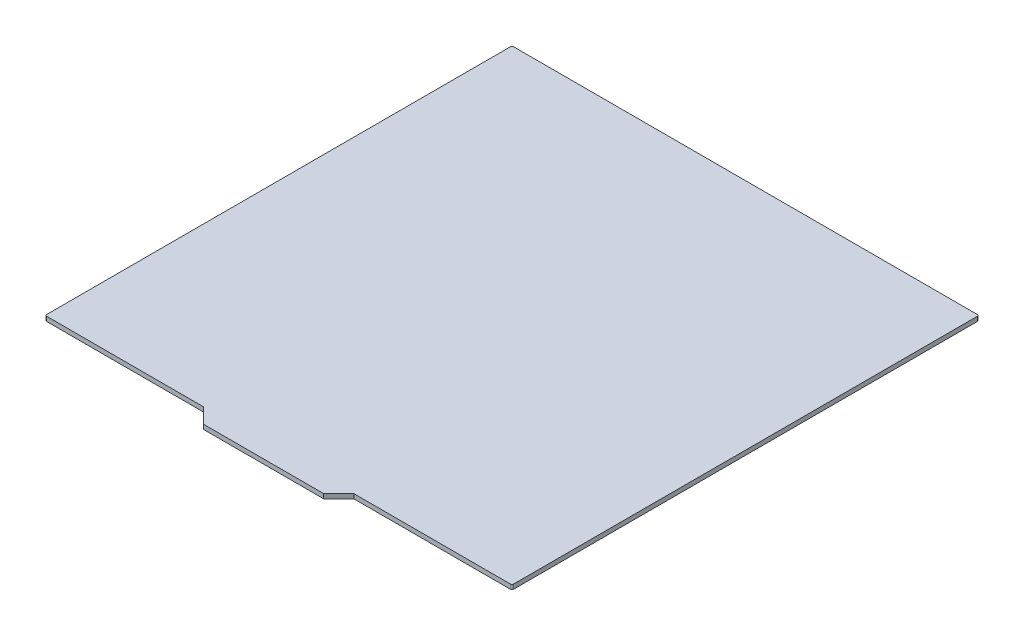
from build123d import *

# Parameters (mm, degrees)
AUFSATZ_LINEAR_AUSTRAGEN1_DEPTH = 3
VERRUNDUNG1_R                   = 1


with BuildPart() as part:
    # Skizze1 → Aufsatz-Linear austragen1 (new body)
    with BuildSketch(Plane(origin=(0, 0, 0), x_dir=(1, 0, 0), z_dir=(0, 1, 0))):
        Polygon((-50, -155), (-40, -165), (40, -165), (50, -155), (155, -155), (155, 155), (-155, 155), (-155, -155), align=None)
    extrude(amount=AUFSATZ_LINEAR_AUSTRAGEN1_DEPTH)

    # Verrundung1
    verrundung1_edges = [part.edges().sort_by_distance(p)[0] for p in [
        (155, 1.5, 155),
        (-155, 1.5, 155),
        (-155, 1.5, -155),
        (155, 1.5, -155),
    ]]
    fillet(verrundung1_edges, radius=VERRUNDUNG1_R)


solid = part.part
